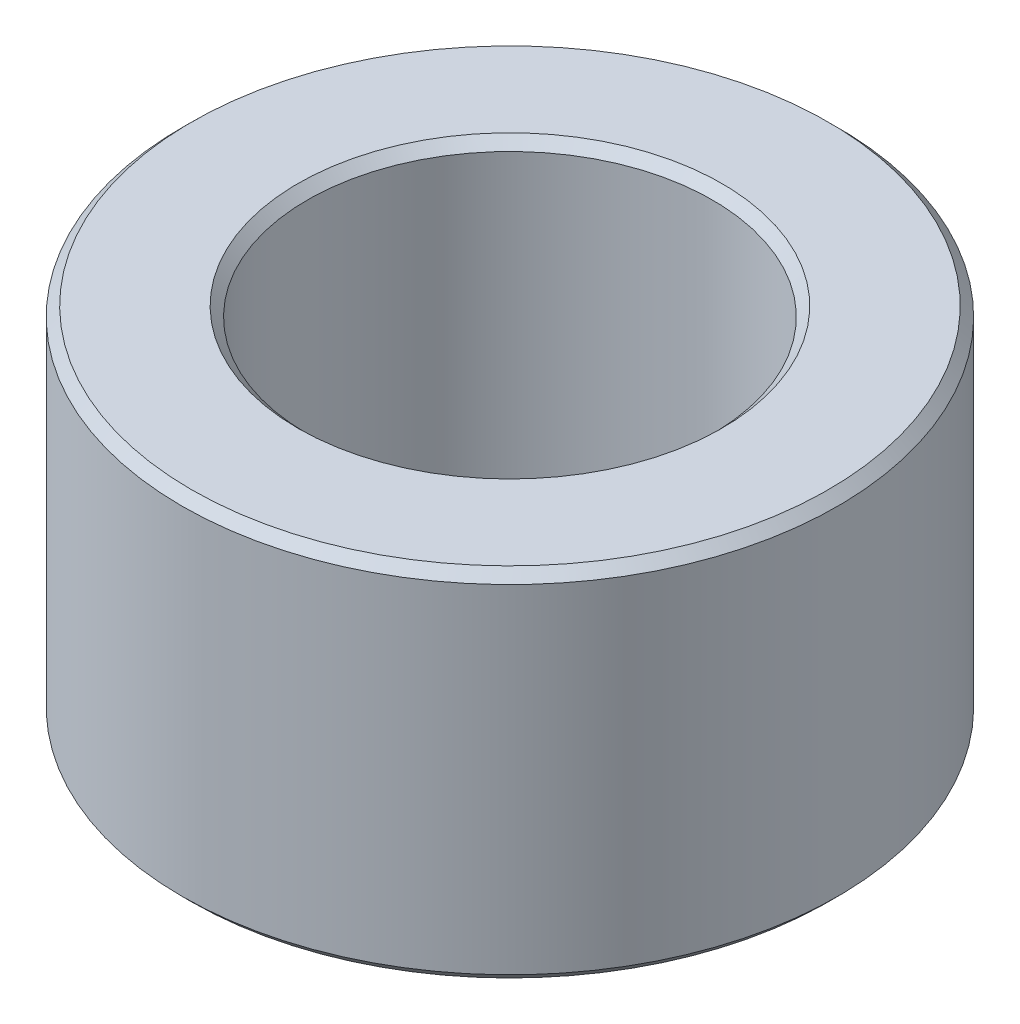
ISO-10303-21;
HEADER;
FILE_DESCRIPTION(('STEP AP214'),'2;1');
FILE_NAME('part.step','',(''),(''),'','','');
FILE_SCHEMA(('AUTOMOTIVE_DESIGN { 1 0 10303 214 1 1 1 1 }'));
ENDSEC;
DATA;
#1=APPLICATION_CONTEXT('core data for automotive mechanical design processes');
#2=APPLICATION_PROTOCOL_DEFINITION('international standard','automotive_design',2000,#1);
#3=PRODUCT_CONTEXT('',#1,'mechanical');
#4=PRODUCT('Part','Part','',(#3));
#5=PRODUCT_RELATED_PRODUCT_CATEGORY('part','',(#4));
#6=PRODUCT_DEFINITION_FORMATION('','',#4);
#7=PRODUCT_DEFINITION_CONTEXT('part definition',#1,'design');
#8=PRODUCT_DEFINITION('design','',#6,#7);
#9=PRODUCT_DEFINITION_SHAPE('','',#8);
#10=(LENGTH_UNIT() NAMED_UNIT(*) SI_UNIT(.MILLI.,.METRE.));
#11=(NAMED_UNIT(*) PLANE_ANGLE_UNIT() SI_UNIT($,.RADIAN.));
#12=(NAMED_UNIT(*) SI_UNIT($,.STERADIAN.) SOLID_ANGLE_UNIT());
#13=UNCERTAINTY_MEASURE_WITH_UNIT(LENGTH_MEASURE(1.E-05),#10,'distance_accuracy_value','');
#14=(GEOMETRIC_REPRESENTATION_CONTEXT(3) GLOBAL_UNCERTAINTY_ASSIGNED_CONTEXT((#13)) GLOBAL_UNIT_ASSIGNED_CONTEXT((#10,
#11,#12)) REPRESENTATION_CONTEXT('',''));
#15=CARTESIAN_POINT('',(0.,0.,0.));
#16=DIRECTION('',(0.,0.,1.));
#17=DIRECTION('',(1.,0.,0.));
#18=AXIS2_PLACEMENT_3D('',#15,#16,#17);
#19=CARTESIAN_POINT('',(0.,4.7,0.));
#20=DIRECTION('',(0.,1.,0.));
#21=DIRECTION('',(0.,0.,1.));
#22=AXIS2_PLACEMENT_3D('',#19,#20,#21);
#23=PLANE('',#22);
#24=CARTESIAN_POINT('',(0.,4.7,0.));
#25=DIRECTION('',(0.,1.,0.));
#26=DIRECTION('',(0.,0.,1.));
#27=AXIS2_PLACEMENT_3D('',#24,#25,#26);
#28=CIRCLE('',#27,5.584);
#29=CARTESIAN_POINT('',(0.,4.7,5.584));
#30=VERTEX_POINT('',#29);
#31=EDGE_CURVE('E11',#30,#30,#28,.F.);
#32=ORIENTED_EDGE('',*,*,#31,.T.);
#33=EDGE_LOOP('',(#32));
#34=FACE_BOUND('',#33,.T.);
#35=CARTESIAN_POINT('',(0.,4.7,0.));
#36=DIRECTION('',(0.,1.,0.));
#37=DIRECTION('',(0.,0.,1.));
#38=AXIS2_PLACEMENT_3D('',#35,#36,#37);
#39=CIRCLE('',#38,8.386);
#40=CARTESIAN_POINT('',(0.,4.7,8.386));
#41=VERTEX_POINT('',#40);
#42=EDGE_CURVE('E43',#41,#41,#39,.T.);
#43=ORIENTED_EDGE('',*,*,#42,.T.);
#44=EDGE_LOOP('',(#43));
#45=FACE_BOUND('',#44,.T.);
#46=ADVANCED_FACE('F36',(#34,#45),#23,.T.);
#47=CARTESIAN_POINT('',(0.,-4.7,0.));
#48=DIRECTION('',(0.,1.,0.));
#49=DIRECTION('',(0.,0.,1.));
#50=AXIS2_PLACEMENT_3D('',#47,#48,#49);
#51=PLANE('',#50);
#52=CARTESIAN_POINT('',(0.,-4.7,0.));
#53=DIRECTION('',(0.,1.,0.));
#54=DIRECTION('',(0.,0.,1.));
#55=AXIS2_PLACEMENT_3D('',#52,#53,#54);
#56=CIRCLE('',#55,5.584);
#57=CARTESIAN_POINT('',(0.,-4.7,5.584));
#58=VERTEX_POINT('',#57);
#59=EDGE_CURVE('E62',#58,#58,#56,.T.);
#60=ORIENTED_EDGE('',*,*,#59,.T.);
#61=EDGE_LOOP('',(#60));
#62=FACE_BOUND('',#61,.T.);
#63=CARTESIAN_POINT('',(0.,-4.7,0.));
#64=DIRECTION('',(0.,1.,0.));
#65=DIRECTION('',(0.,0.,1.));
#66=AXIS2_PLACEMENT_3D('',#63,#64,#65);
#67=CIRCLE('',#66,8.386);
#68=CARTESIAN_POINT('',(0.,-4.7,8.386));
#69=VERTEX_POINT('',#68);
#70=EDGE_CURVE('E65',#69,#69,#67,.F.);
#71=ORIENTED_EDGE('',*,*,#70,.T.);
#72=EDGE_LOOP('',(#71));
#73=FACE_BOUND('',#72,.T.);
#74=ADVANCED_FACE('F69',(#62,#73),#51,.F.);
#75=CARTESIAN_POINT('',(0.,4.7,0.));
#76=DIRECTION('',(0.,-1.,0.));
#77=DIRECTION('',(0.,0.,-1.));
#78=AXIS2_PLACEMENT_3D('',#75,#76,#77);
#79=CYLINDRICAL_SURFACE('',#78,8.636);
#80=CARTESIAN_POINT('',(0.,-4.45,0.));
#81=DIRECTION('',(0.,1.,0.));
#82=DIRECTION('',(0.,0.,1.));
#83=AXIS2_PLACEMENT_3D('',#80,#81,#82);
#84=CIRCLE('',#83,8.636);
#85=CARTESIAN_POINT('',(0.,-4.45,8.636));
#86=VERTEX_POINT('',#85);
#87=EDGE_CURVE('E47',#86,#86,#84,.T.);
#88=ORIENTED_EDGE('',*,*,#87,.T.);
#89=EDGE_LOOP('',(#88));
#90=FACE_BOUND('',#89,.T.);
#91=CARTESIAN_POINT('',(0.,4.45,0.));
#92=DIRECTION('',(0.,1.,0.));
#93=DIRECTION('',(0.,0.,1.));
#94=AXIS2_PLACEMENT_3D('',#91,#92,#93);
#95=CIRCLE('',#94,8.636);
#96=CARTESIAN_POINT('',(0.,4.45,8.636));
#97=VERTEX_POINT('',#96);
#98=EDGE_CURVE('E51',#97,#97,#95,.F.);
#99=ORIENTED_EDGE('',*,*,#98,.T.);
#100=EDGE_LOOP('',(#99));
#101=FACE_BOUND('',#100,.T.);
#102=ADVANCED_FACE('F79',(#90,#101),#79,.T.);
#103=CARTESIAN_POINT('',(0.,4.7,0.));
#104=DIRECTION('',(0.,-1.,0.));
#105=DIRECTION('',(0.,0.,-1.));
#106=AXIS2_PLACEMENT_3D('',#103,#104,#105);
#107=CYLINDRICAL_SURFACE('',#106,5.334);
#108=CARTESIAN_POINT('',(0.,-4.45,0.));
#109=DIRECTION('',(0.,1.,0.));
#110=DIRECTION('',(0.,0.,1.));
#111=AXIS2_PLACEMENT_3D('',#108,#109,#110);
#112=CIRCLE('',#111,5.334);
#113=CARTESIAN_POINT('',(0.,-4.45,5.334));
#114=VERTEX_POINT('',#113);
#115=EDGE_CURVE('E56',#114,#114,#112,.F.);
#116=ORIENTED_EDGE('',*,*,#115,.T.);
#117=EDGE_LOOP('',(#116));
#118=FACE_BOUND('',#117,.T.);
#119=CARTESIAN_POINT('',(0.,4.45,0.));
#120=DIRECTION('',(0.,1.,0.));
#121=DIRECTION('',(0.,0.,1.));
#122=AXIS2_PLACEMENT_3D('',#119,#120,#121);
#123=CIRCLE('',#122,5.334);
#124=CARTESIAN_POINT('',(0.,4.45,5.334));
#125=VERTEX_POINT('',#124);
#126=EDGE_CURVE('E59',#125,#125,#123,.T.);
#127=ORIENTED_EDGE('',*,*,#126,.T.);
#128=EDGE_LOOP('',(#127));
#129=FACE_BOUND('',#128,.T.);
#130=ADVANCED_FACE('F82',(#118,#129),#107,.F.);
#131=CARTESIAN_POINT('',(0.,-4.7,0.));
#132=DIRECTION('',(0.,-1.,0.));
#133=DIRECTION('',(0.,0.,-1.));
#134=AXIS2_PLACEMENT_3D('',#131,#132,#133);
#135=CONICAL_SURFACE('',#134,5.584,0.785398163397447);
#136=ORIENTED_EDGE('',*,*,#115,.F.);
#137=EDGE_LOOP('',(#136));
#138=FACE_BOUND('',#137,.T.);
#139=ORIENTED_EDGE('',*,*,#59,.F.);
#140=EDGE_LOOP('',(#139));
#141=FACE_BOUND('',#140,.T.);
#142=ADVANCED_FACE('F75',(#138,#141),#135,.F.);
#143=CARTESIAN_POINT('',(0.,-4.45,0.));
#144=DIRECTION('',(0.,1.,0.));
#145=DIRECTION('',(0.,0.,1.));
#146=AXIS2_PLACEMENT_3D('',#143,#144,#145);
#147=CONICAL_SURFACE('',#146,8.636,0.785398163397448);
#148=ORIENTED_EDGE('',*,*,#70,.F.);
#149=EDGE_LOOP('',(#148));
#150=FACE_BOUND('',#149,.T.);
#151=ORIENTED_EDGE('',*,*,#87,.F.);
#152=EDGE_LOOP('',(#151));
#153=FACE_BOUND('',#152,.T.);
#154=ADVANCED_FACE('F71',(#150,#153),#147,.T.);
#155=CARTESIAN_POINT('',(0.,4.45,0.));
#156=DIRECTION('',(0.,1.,0.));
#157=DIRECTION('',(0.,0.,1.));
#158=AXIS2_PLACEMENT_3D('',#155,#156,#157);
#159=CONICAL_SURFACE('',#158,5.334,0.785398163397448);
#160=ORIENTED_EDGE('',*,*,#31,.F.);
#161=EDGE_LOOP('',(#160));
#162=FACE_BOUND('',#161,.T.);
#163=ORIENTED_EDGE('',*,*,#126,.F.);
#164=EDGE_LOOP('',(#163));
#165=FACE_BOUND('',#164,.T.);
#166=ADVANCED_FACE('F74',(#162,#165),#159,.F.);
#167=CARTESIAN_POINT('',(0.,4.7,0.));
#168=DIRECTION('',(0.,-1.,0.));
#169=DIRECTION('',(0.,0.,-1.));
#170=AXIS2_PLACEMENT_3D('',#167,#168,#169);
#171=CONICAL_SURFACE('',#170,8.386,0.785398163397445);
#172=ORIENTED_EDGE('',*,*,#98,.F.);
#173=EDGE_LOOP('',(#172));
#174=FACE_BOUND('',#173,.T.);
#175=ORIENTED_EDGE('',*,*,#42,.F.);
#176=EDGE_LOOP('',(#175));
#177=FACE_BOUND('',#176,.T.);
#178=ADVANCED_FACE('F38',(#174,#177),#171,.T.);
#179=CLOSED_SHELL('',(#46,#74,#102,#130,#142,#154,#166,#178));
#180=MANIFOLD_SOLID_BREP('B2',#179);
#181=ADVANCED_BREP_SHAPE_REPRESENTATION('',(#18,#180),#14);
#182=SHAPE_DEFINITION_REPRESENTATION(#9,#181);
ENDSEC;
END-ISO-10303-21;
